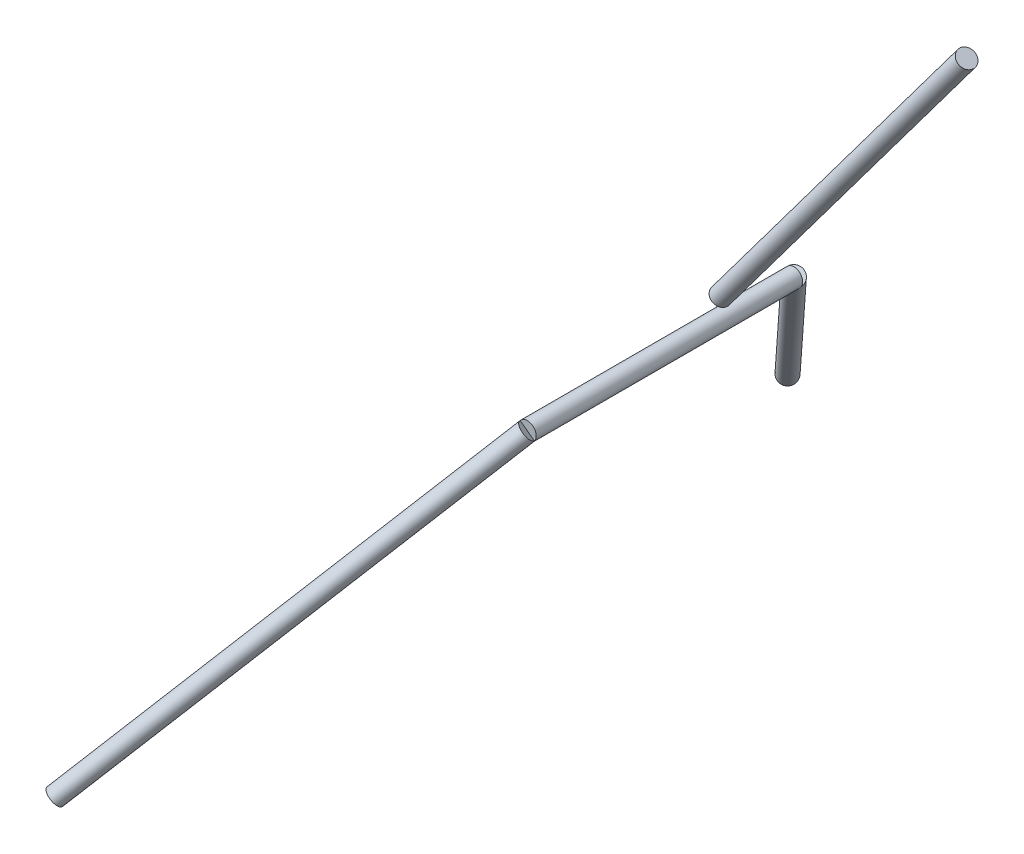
ISO-10303-21;
HEADER;
FILE_DESCRIPTION(('STEP AP214'),'2;1');
FILE_NAME('part.step','',(''),(''),'','','');
FILE_SCHEMA(('AUTOMOTIVE_DESIGN { 1 0 10303 214 1 1 1 1 }'));
ENDSEC;
DATA;
#1=APPLICATION_CONTEXT('core data for automotive mechanical design processes');
#2=APPLICATION_PROTOCOL_DEFINITION('international standard','automotive_design',2000,#1);
#3=PRODUCT_CONTEXT('',#1,'mechanical');
#4=PRODUCT('Part','Part','',(#3));
#5=PRODUCT_RELATED_PRODUCT_CATEGORY('part','',(#4));
#6=PRODUCT_DEFINITION_FORMATION('','',#4);
#7=PRODUCT_DEFINITION_CONTEXT('part definition',#1,'design');
#8=PRODUCT_DEFINITION('design','',#6,#7);
#9=PRODUCT_DEFINITION_SHAPE('','',#8);
#10=(LENGTH_UNIT() NAMED_UNIT(*) SI_UNIT(.MILLI.,.METRE.));
#11=(NAMED_UNIT(*) PLANE_ANGLE_UNIT() SI_UNIT($,.RADIAN.));
#12=(NAMED_UNIT(*) SI_UNIT($,.STERADIAN.) SOLID_ANGLE_UNIT());
#13=UNCERTAINTY_MEASURE_WITH_UNIT(LENGTH_MEASURE(1.E-05),#10,'distance_accuracy_value','');
#14=(GEOMETRIC_REPRESENTATION_CONTEXT(3) GLOBAL_UNCERTAINTY_ASSIGNED_CONTEXT((#13)) GLOBAL_UNIT_ASSIGNED_CONTEXT((#10,
#11,#12)) REPRESENTATION_CONTEXT('',''));
#15=CARTESIAN_POINT('',(0.,0.,0.));
#16=DIRECTION('',(0.,0.,1.));
#17=DIRECTION('',(1.,0.,0.));
#18=AXIS2_PLACEMENT_3D('',#15,#16,#17);
#19=CARTESIAN_POINT('',(-192.431415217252,410.982106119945,0.));
#20=DIRECTION('',(0.599126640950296,0.800654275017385,0.));
#21=DIRECTION('',(-0.800654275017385,0.599126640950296,0.));
#22=AXIS2_PLACEMENT_3D('',#19,#20,#21);
#23=PLANE('',#22);
#24=CARTESIAN_POINT('',(-192.431415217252,410.982106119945,0.));
#25=DIRECTION('',(0.599126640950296,0.800654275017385,0.));
#26=DIRECTION('',(-0.800654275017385,0.599126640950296,0.));
#27=AXIS2_PLACEMENT_3D('',#24,#25,#26);
#28=CIRCLE('',#27,0.800000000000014);
#29=CARTESIAN_POINT('',(-193.071938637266,411.461407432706,0.));
#30=VERTEX_POINT('',#29);
#31=EDGE_CURVE('E72',#30,#30,#28,.T.);
#32=ORIENTED_EDGE('',*,*,#31,.F.);
#33=EDGE_LOOP('',(#32));
#34=FACE_BOUND('',#33,.T.);
#35=ADVANCED_FACE('F66',(#34),#23,.F.);
#36=CARTESIAN_POINT('',(-170.263729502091,440.606314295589,0.));
#37=DIRECTION('',(0.599126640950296,0.800654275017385,0.));
#38=DIRECTION('',(-0.800654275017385,0.599126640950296,0.));
#39=AXIS2_PLACEMENT_3D('',#36,#37,#38);
#40=PLANE('',#39);
#41=CARTESIAN_POINT('',(-170.263729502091,440.606314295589,0.));
#42=DIRECTION('',(0.599126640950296,0.800654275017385,0.));
#43=DIRECTION('',(-0.800654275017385,0.599126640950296,0.));
#44=AXIS2_PLACEMENT_3D('',#41,#42,#43);
#45=CIRCLE('',#44,0.800000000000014);
#46=CARTESIAN_POINT('',(-170.904252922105,441.085615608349,0.));
#47=VERTEX_POINT('',#46);
#48=EDGE_CURVE('E12',#47,#47,#45,.T.);
#49=ORIENTED_EDGE('',*,*,#48,.T.);
#50=EDGE_LOOP('',(#49));
#51=FACE_BOUND('',#50,.T.);
#52=ADVANCED_FACE('F81',(#51),#40,.T.);
#53=CARTESIAN_POINT('',(-192.431415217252,410.982106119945,0.));
#54=DIRECTION('',(0.599126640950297,0.800654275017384,0.));
#55=DIRECTION('',(-0.800654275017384,0.599126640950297,0.));
#56=AXIS2_PLACEMENT_3D('',#53,#54,#55);
#57=CYLINDRICAL_SURFACE('',#56,0.800000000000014);
#58=ORIENTED_EDGE('',*,*,#48,.F.);
#59=EDGE_LOOP('',(#58));
#60=FACE_BOUND('',#59,.T.);
#61=ORIENTED_EDGE('',*,*,#31,.T.);
#62=EDGE_LOOP('',(#61));
#63=FACE_BOUND('',#62,.T.);
#64=ADVANCED_FACE('F78',(#60,#63),#57,.T.);
#65=CLOSED_SHELL('',(#35,#52,#64));
#66=MANIFOLD_SOLID_BREP('B2',#65);
#67=CARTESIAN_POINT('',(-197.823554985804,403.776217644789,12.));
#68=DIRECTION('',(0.,0.,1.));
#69=DIRECTION('',(1.,0.,0.));
#70=AXIS2_PLACEMENT_3D('',#67,#68,#69);
#71=PLANE('',#70);
#72=CARTESIAN_POINT('',(-197.823554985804,403.776217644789,12.));
#73=DIRECTION('',(0.,0.,1.));
#74=DIRECTION('',(1.,0.,0.));
#75=AXIS2_PLACEMENT_3D('',#72,#73,#74);
#76=CIRCLE('',#75,0.799999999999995);
#77=CARTESIAN_POINT('',(-197.183031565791,403.296916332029,11.9999999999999));
#78=VERTEX_POINT('',#77);
#79=CARTESIAN_POINT('',(-198.464078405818,404.255518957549,12.));
#80=VERTEX_POINT('',#79);
#81=EDGE_CURVE('E129',#78,#80,#76,.T.);
#82=ORIENTED_EDGE('',*,*,#81,.T.);
#83=DIRECTION('',(0.800654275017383,-0.599126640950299,0.));
#84=VECTOR('',#83,1.);
#85=CARTESIAN_POINT('',(-197.823554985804,403.776217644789,12.));
#86=LINE('',#85,#84);
#87=EDGE_CURVE('E138',#80,#78,#86,.T.);
#88=ORIENTED_EDGE('',*,*,#87,.T.);
#89=EDGE_LOOP('',(#82,#88));
#90=FACE_BOUND('',#89,.T.);
#91=ADVANCED_FACE('F106',(#90),#71,.T.);
#92=CARTESIAN_POINT('',(-197.823554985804,403.776217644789,-11.9999999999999));
#93=DIRECTION('',(0.517512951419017,0.69158826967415,0.503871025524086));
#94=DIRECTION('',(-0.800654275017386,0.599126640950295,0.));
#95=AXIS2_PLACEMENT_3D('',#92,#93,#94);
#96=PLANE('',#95);
#97=CARTESIAN_POINT('',(-197.823554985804,403.776217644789,-11.9999999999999));
#98=DIRECTION('',(0.517512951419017,0.69158826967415,0.503871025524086));
#99=DIRECTION('',(-0.800654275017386,0.599126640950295,0.));
#100=AXIS2_PLACEMENT_3D('',#97,#98,#99);
#101=CIRCLE('',#100,0.80000000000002);
#102=CARTESIAN_POINT('',(-197.183031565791,403.296916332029,-12.));
#103=VERTEX_POINT('',#102);
#104=CARTESIAN_POINT('',(-198.464078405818,404.255518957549,-12.));
#105=VERTEX_POINT('',#104);
#106=EDGE_CURVE('E159',#103,#105,#101,.T.);
#107=ORIENTED_EDGE('',*,*,#106,.T.);
#108=DIRECTION('',(0.800654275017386,-0.599126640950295,0.));
#109=VECTOR('',#108,1.);
#110=CARTESIAN_POINT('',(-197.823554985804,403.776217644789,-11.9999999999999));
#111=LINE('',#110,#109);
#112=EDGE_CURVE('E135',#105,#103,#111,.T.);
#113=ORIENTED_EDGE('',*,*,#112,.T.);
#114=EDGE_LOOP('',(#107,#113));
#115=FACE_BOUND('',#114,.T.);
#116=ADVANCED_FACE('F165',(#115),#96,.T.);
#117=CARTESIAN_POINT('',(-219.392114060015,374.952663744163,-33.));
#118=DIRECTION('',(0.517512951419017,0.69158826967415,0.503871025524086));
#119=DIRECTION('',(-0.800654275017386,0.599126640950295,0.));
#120=AXIS2_PLACEMENT_3D('',#117,#118,#119);
#121=PLANE('',#120);
#122=CARTESIAN_POINT('',(-219.392114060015,374.952663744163,-33.));
#123=DIRECTION('',(0.517512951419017,0.69158826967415,0.503871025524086));
#124=DIRECTION('',(-0.800654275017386,0.599126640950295,0.));
#125=AXIS2_PLACEMENT_3D('',#122,#123,#124);
#126=CIRCLE('',#125,0.80000000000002);
#127=CARTESIAN_POINT('',(-220.032637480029,375.431965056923,-33.));
#128=VERTEX_POINT('',#127);
#129=EDGE_CURVE('E156',#128,#128,#126,.T.);
#130=ORIENTED_EDGE('',*,*,#129,.F.);
#131=EDGE_LOOP('',(#130));
#132=FACE_BOUND('',#131,.T.);
#133=ADVANCED_FACE('F108',(#132),#121,.F.);
#134=CARTESIAN_POINT('',(-219.392114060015,374.952663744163,-33.));
#135=DIRECTION('',(0.517512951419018,0.691588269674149,0.503871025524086));
#136=DIRECTION('',(-0.800654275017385,0.599126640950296,0.));
#137=AXIS2_PLACEMENT_3D('',#134,#135,#136);
#138=CYLINDRICAL_SURFACE('',#137,0.80000000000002);
#139=CARTESIAN_POINT('',(-197.823554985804,403.776217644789,-11.9999999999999));
#140=DIRECTION('',(0.298401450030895,0.398774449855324,0.867142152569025));
#141=DIRECTION('',(0.51952796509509,0.694281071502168,-0.498060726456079));
#142=AXIS2_PLACEMENT_3D('',#139,#140,#141);
#143=ELLIPSE('',#142,0.922570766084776,0.800000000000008);
#144=EDGE_CURVE('E114',#105,#103,#143,.T.);
#145=ORIENTED_EDGE('',*,*,#144,.F.);
#146=ORIENTED_EDGE('',*,*,#106,.F.);
#147=EDGE_LOOP('',(#145,#146));
#148=FACE_BOUND('',#147,.T.);
#149=ORIENTED_EDGE('',*,*,#129,.T.);
#150=EDGE_LOOP('',(#149));
#151=FACE_BOUND('',#150,.T.);
#152=ADVANCED_FACE('F166',(#148,#151),#138,.T.);
#153=CARTESIAN_POINT('',(-197.823554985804,403.776217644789,-12.));
#154=DIRECTION('',(0.,0.,1.));
#155=DIRECTION('',(1.,0.,0.));
#156=AXIS2_PLACEMENT_3D('',#153,#154,#155);
#157=PLANE('',#156);
#158=ORIENTED_EDGE('',*,*,#112,.F.);
#159=CARTESIAN_POINT('',(-197.823554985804,403.776217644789,-12.));
#160=DIRECTION('',(0.,0.,1.));
#161=DIRECTION('',(1.,0.,0.));
#162=AXIS2_PLACEMENT_3D('',#159,#160,#161);
#163=CIRCLE('',#162,0.799999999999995);
#164=EDGE_CURVE('E136',#103,#105,#163,.T.);
#165=ORIENTED_EDGE('',*,*,#164,.F.);
#166=EDGE_LOOP('',(#158,#165));
#167=FACE_BOUND('',#166,.T.);
#168=ADVANCED_FACE('F163',(#167),#157,.F.);
#169=CARTESIAN_POINT('',(-197.823554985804,403.776217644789,-12.));
#170=DIRECTION('',(0.,0.,1.));
#171=DIRECTION('',(1.,0.,0.));
#172=AXIS2_PLACEMENT_3D('',#169,#170,#171);
#173=CYLINDRICAL_SURFACE('',#172,0.799999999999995);
#174=CARTESIAN_POINT('',(-197.823554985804,403.776217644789,12.));
#175=DIRECTION('',(-0.298401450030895,-0.398774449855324,0.867142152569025));
#176=DIRECTION('',(0.51952796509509,0.694281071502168,0.498060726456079));
#177=AXIS2_PLACEMENT_3D('',#174,#175,#176);
#178=ELLIPSE('',#177,0.922570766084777,0.800000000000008);
#179=EDGE_CURVE('E64',#80,#78,#178,.T.);
#180=ORIENTED_EDGE('',*,*,#179,.F.);
#181=ORIENTED_EDGE('',*,*,#81,.F.);
#182=EDGE_LOOP('',(#180,#181));
#183=FACE_BOUND('',#182,.T.);
#184=ORIENTED_EDGE('',*,*,#164,.T.);
#185=ORIENTED_EDGE('',*,*,#144,.T.);
#186=EDGE_LOOP('',(#184,#185));
#187=FACE_BOUND('',#186,.T.);
#188=ADVANCED_FACE('F131',(#183,#187),#173,.T.);
#189=CARTESIAN_POINT('',(-197.823554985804,403.776217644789,12.));
#190=DIRECTION('',(-0.51751295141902,-0.691588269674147,0.503871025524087));
#191=DIRECTION('',(0.800654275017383,-0.599126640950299,0.));
#192=AXIS2_PLACEMENT_3D('',#189,#190,#191);
#193=PLANE('',#192);
#194=ORIENTED_EDGE('',*,*,#87,.F.);
#195=CARTESIAN_POINT('',(-197.823554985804,403.776217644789,12.));
#196=DIRECTION('',(-0.51751295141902,-0.691588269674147,0.503871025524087));
#197=DIRECTION('',(0.800654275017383,-0.599126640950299,0.));
#198=AXIS2_PLACEMENT_3D('',#195,#196,#197);
#199=CIRCLE('',#198,0.800000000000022);
#200=EDGE_CURVE('E146',#78,#80,#199,.T.);
#201=ORIENTED_EDGE('',*,*,#200,.F.);
#202=EDGE_LOOP('',(#194,#201));
#203=FACE_BOUND('',#202,.T.);
#204=ADVANCED_FACE('F147',(#203),#193,.F.);
#205=CARTESIAN_POINT('',(-219.392114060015,374.952663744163,33.));
#206=DIRECTION('',(-0.51751295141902,-0.691588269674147,0.503871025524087));
#207=DIRECTION('',(0.800654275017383,-0.599126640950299,0.));
#208=AXIS2_PLACEMENT_3D('',#205,#206,#207);
#209=PLANE('',#208);
#210=CARTESIAN_POINT('',(-219.392114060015,374.952663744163,33.));
#211=DIRECTION('',(-0.51751295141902,-0.691588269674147,0.503871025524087));
#212=DIRECTION('',(0.800654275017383,-0.599126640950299,0.));
#213=AXIS2_PLACEMENT_3D('',#210,#211,#212);
#214=CIRCLE('',#213,0.800000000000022);
#215=CARTESIAN_POINT('',(-218.751590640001,374.473362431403,33.));
#216=VERTEX_POINT('',#215);
#217=EDGE_CURVE('E142',#216,#216,#214,.T.);
#218=ORIENTED_EDGE('',*,*,#217,.T.);
#219=EDGE_LOOP('',(#218));
#220=FACE_BOUND('',#219,.T.);
#221=ADVANCED_FACE('F188',(#220),#209,.T.);
#222=CARTESIAN_POINT('',(-197.823554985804,403.776217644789,12.));
#223=DIRECTION('',(-0.517512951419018,-0.691588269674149,0.503871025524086));
#224=DIRECTION('',(0.800654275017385,-0.599126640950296,0.));
#225=AXIS2_PLACEMENT_3D('',#222,#223,#224);
#226=CYLINDRICAL_SURFACE('',#225,0.800000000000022);
#227=ORIENTED_EDGE('',*,*,#217,.F.);
#228=EDGE_LOOP('',(#227));
#229=FACE_BOUND('',#228,.T.);
#230=ORIENTED_EDGE('',*,*,#200,.T.);
#231=ORIENTED_EDGE('',*,*,#179,.T.);
#232=EDGE_LOOP('',(#230,#231));
#233=FACE_BOUND('',#232,.T.);
#234=ADVANCED_FACE('F145',(#229,#233),#226,.T.);
#235=CLOSED_SHELL('',(#91,#116,#133,#152,#168,#188,#204,#221,#234));
#236=MANIFOLD_SOLID_BREP('B7',#235);
#237=ADVANCED_BREP_SHAPE_REPRESENTATION('',(#18,#66,#236),#14);
#238=SHAPE_DEFINITION_REPRESENTATION(#9,#237);
ENDSEC;
END-ISO-10303-21;
